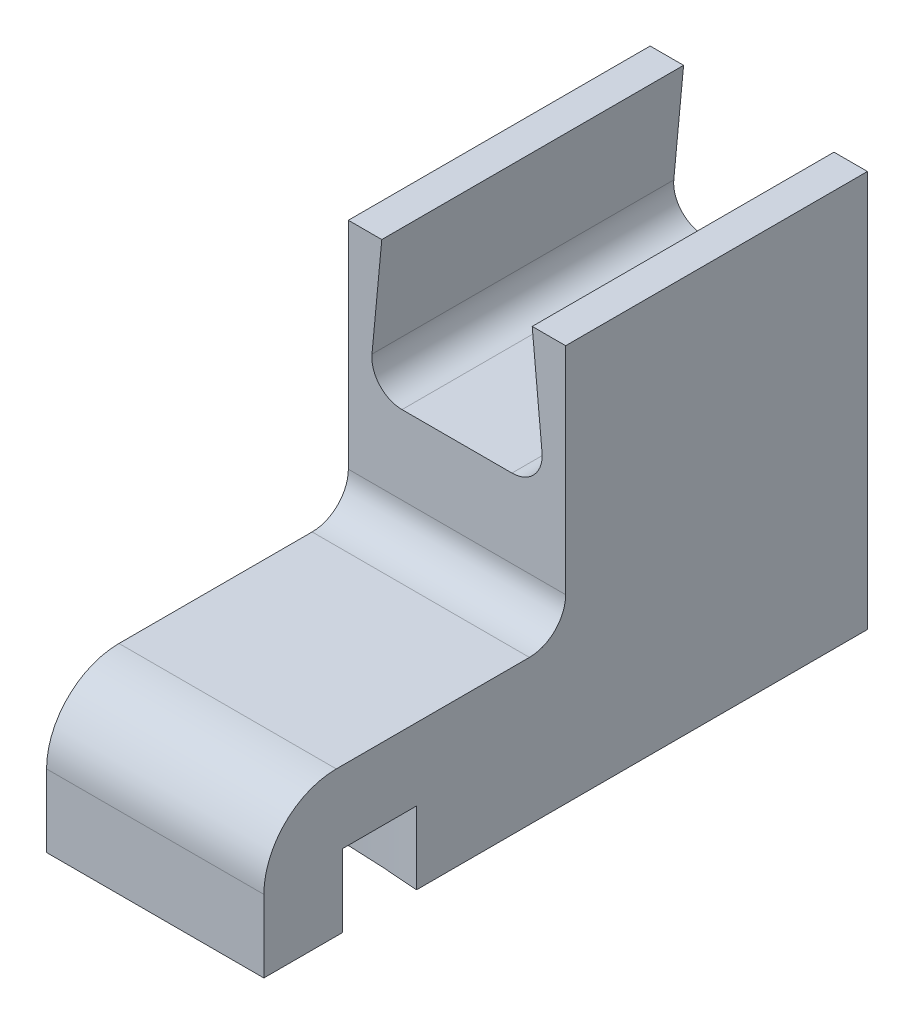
from build123d import *

# Parameters (mm, degrees)
SALIENTE_EXTRUIR1_DEPTH = 25
CROQUIS3_W              = 18
CROQUIS3_H              = 25
SALIENTE_EXTRUIR2_DEPTH = 12
CORTAR_EXTRUIR1_DEPTH   = 6.02
REDONDEO1_R             = 2.5
REDONDEO2_R             = 6
REDONDEO3_R             = 3


with BuildPart() as part:
    # Croquis1 → Saliente-Extruir1 (new body)
    with BuildSketch(Plane.XY):
        Polygon((-9, 4.26), (-9, -28.6), (9, -28.6), (9, 4.26), (6.23, 4.26), (7.3, -7.1), (-7.3, -7.1), (-6.23, 4.26), align=None)
    extrude(amount=SALIENTE_EXTRUIR1_DEPTH)

    # Croquis3 → Saliente-Extruir2 (add)
    with BuildSketch(Plane.XZ.offset(28.6)):
        with Locations((0, 37.5)):
            Rectangle(CROQUIS3_W, CROQUIS3_H)
    extrude(amount=-SALIENTE_EXTRUIR2_DEPTH)

    # Croquis4 → Cortar-Extruir1 (cut)
    with BuildSketch(Plane.XZ.offset(28.6)):
        with BuildLine():
            Line((-9, 43.482073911), (-9, 37.355619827))
            ThreePointArc((-9, 37.355619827), (0, 36.95), (9, 37.355619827))
            Line((9, 37.355619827), (9, 43.482073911))
            ThreePointArc((9, 43.482073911), (0, 43.05), (-9, 43.482073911))
        make_face()
    extrude(amount=-CORTAR_EXTRUIR1_DEPTH, mode=Mode.SUBTRACT)

    # Redondeo1
    redondeo1_edges = [part.edges().sort_by_distance(p)[0] for p in [
        (-7.3, -7.1, 12.5),
        (7.3, -7.1, 12.5),
    ]]
    fillet(redondeo1_edges, radius=REDONDEO1_R)

    # Redondeo2
    redondeo2_edges = [part.edges().sort_by_distance(p)[0] for p in [
        (0, -16.6, 50),
    ]]
    fillet(redondeo2_edges, radius=REDONDEO2_R)

    # Redondeo3
    redondeo3_edges = [part.edges().sort_by_distance(p)[0] for p in [
        (0, -16.6, 25),
    ]]
    fillet(redondeo3_edges, radius=REDONDEO3_R)


solid = part.part
